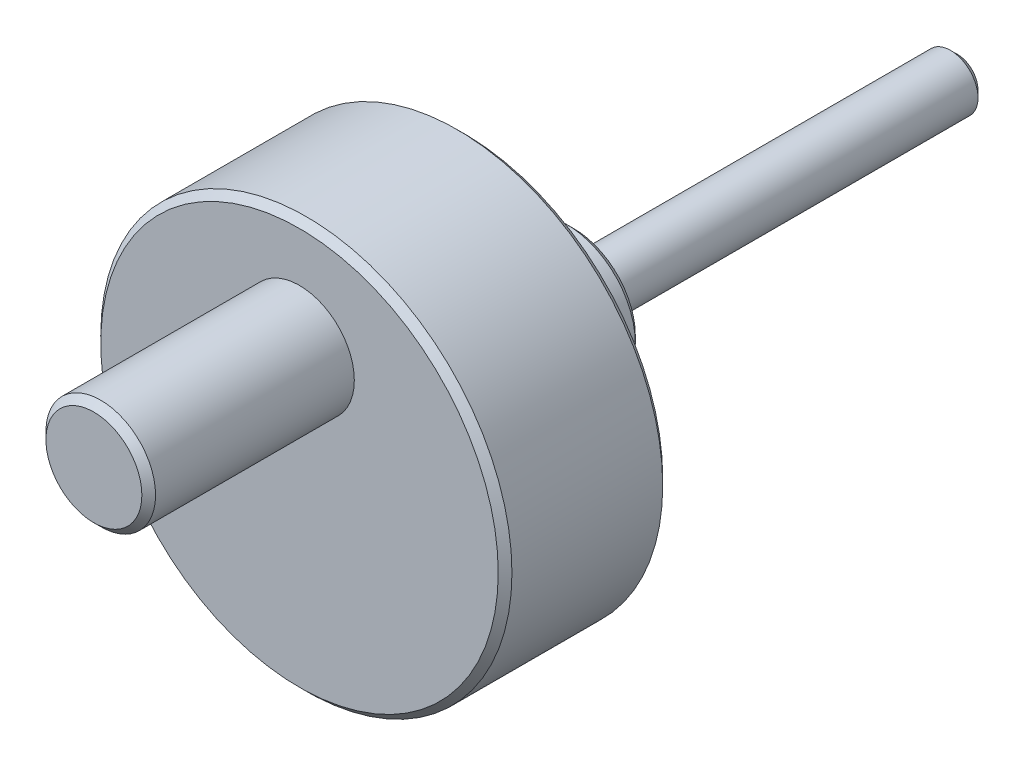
from build123d import *

# Parameters (mm, degrees)
ESQUISSE1_R        = 1
BOSS_EXTRU_1_DEPTH = 14
ESQUISSE2_R        = 2.5
BOSS_EXTRU_2_DEPTH = 4
ESQUISSE3_R        = 7.5
BOSS_EXTRU_3_DEPTH = 6
ESQUISSE4_R        = 2
BOSS_EXTRU_4_DEPTH = 7.5
CHANFREIN1_SIZE    = 0.25


with BuildPart() as part:
    # Esquisse1 → Boss.-Extru.1 (new body)
    with BuildSketch(Plane.XY):
        Circle(ESQUISSE1_R)
    extrude(amount=BOSS_EXTRU_1_DEPTH)

    # Esquisse2 → Boss.-Extru.2 (add)
    with BuildSketch(Plane.XY.offset(14)):
        Circle(ESQUISSE2_R)
    extrude(amount=BOSS_EXTRU_2_DEPTH)

    # Esquisse3 → Boss.-Extru.3 (add)
    with BuildSketch(Plane.XY.offset(18)):
        Circle(ESQUISSE3_R)
    extrude(amount=BOSS_EXTRU_3_DEPTH)

    # Esquisse4 → Boss.-Extru.4 (add)
    with BuildSketch(Plane.XY.offset(24)):
        with Locations((0, 3.45)):
            Circle(ESQUISSE4_R)
    extrude(amount=BOSS_EXTRU_4_DEPTH)

    # Chanfrein1
    chanfrein1_edges = [part.edges().sort_by_distance(p)[0] for p in [
        (-2, 3.45, 31.5),
        (-1, 0, 0),
        (-2.5, 0, 14),
        (-7.5, 0, 18),
        (-7.5, 0, 24),
    ]]
    chamfer(chanfrein1_edges, length=CHANFREIN1_SIZE)


solid = part.part
